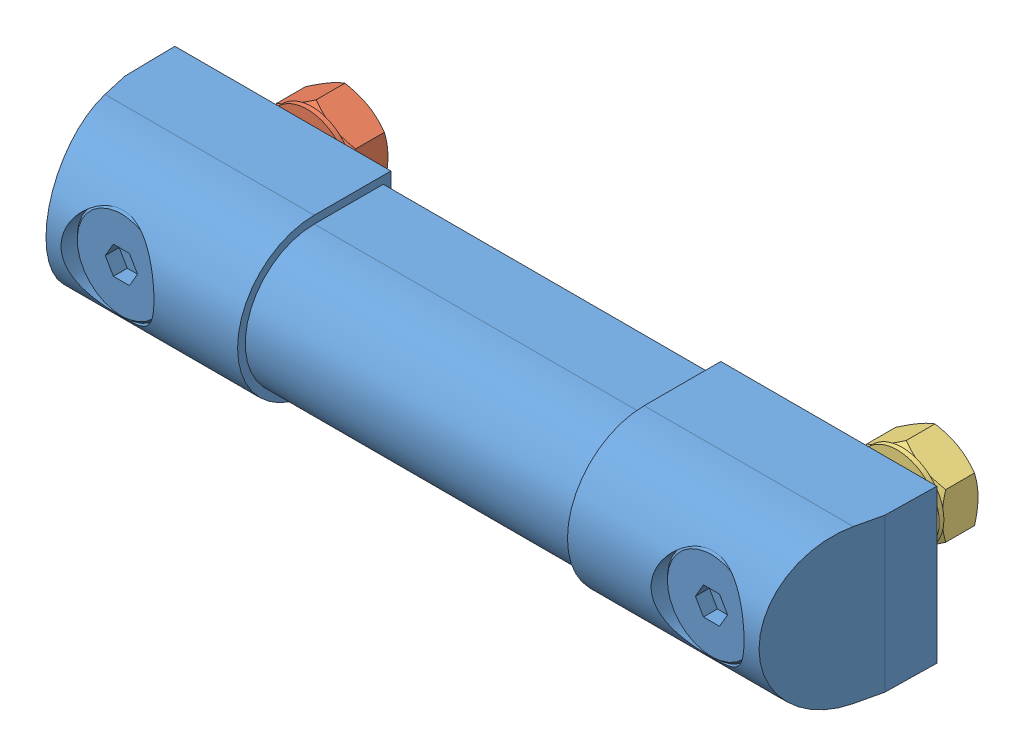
SolidWorks assembly CLR127GL-SR-SUS.sldasm, configuration Default (file format 15000). Lengths in mm.
Overall size (164 33 53).
3 component instances, 3 part files, 0 mates.
Components (placement in the parent):
- CLR-127GL-SR-SUS_01-1: CLR-127GL-SR-SUS_01.sldprt [Default] at origin size (164 33 53)
- CLR-127GL-SR-SUS_02-1: CLR-127GL-SR-SUS_02.sldprt [Default] at (0 0 -10) x (-1 0 0) z (0 0 -1) size (18 19.63 9)
- CLR-127GL-SR-SUS_03-1: CLR-127GL-SR-SUS_03.sldprt [Default] at (127 0 -10) x (-1 0 0) z (0 0 -1) size (18 19.63 9)
